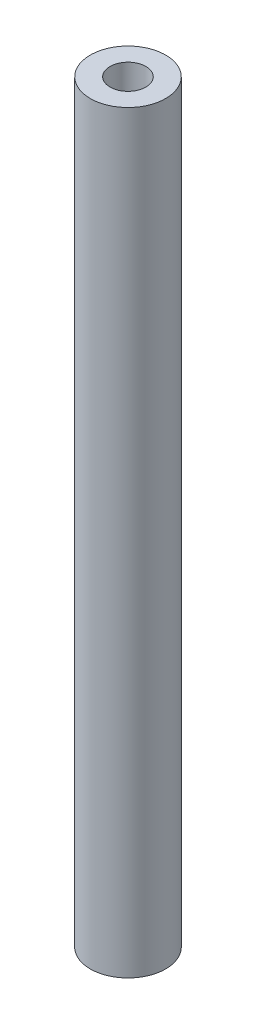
ISO-10303-21;
HEADER;
FILE_DESCRIPTION(('STEP AP214'),'2;1');
FILE_NAME('part.step','',(''),(''),'','','');
FILE_SCHEMA(('AUTOMOTIVE_DESIGN { 1 0 10303 214 1 1 1 1 }'));
ENDSEC;
DATA;
#1=APPLICATION_CONTEXT('core data for automotive mechanical design processes');
#2=APPLICATION_PROTOCOL_DEFINITION('international standard','automotive_design',2000,#1);
#3=PRODUCT_CONTEXT('',#1,'mechanical');
#4=PRODUCT('Part','Part','',(#3));
#5=PRODUCT_RELATED_PRODUCT_CATEGORY('part','',(#4));
#6=PRODUCT_DEFINITION_FORMATION('','',#4);
#7=PRODUCT_DEFINITION_CONTEXT('part definition',#1,'design');
#8=PRODUCT_DEFINITION('design','',#6,#7);
#9=PRODUCT_DEFINITION_SHAPE('','',#8);
#10=(LENGTH_UNIT() NAMED_UNIT(*) SI_UNIT(.MILLI.,.METRE.));
#11=(NAMED_UNIT(*) PLANE_ANGLE_UNIT() SI_UNIT($,.RADIAN.));
#12=(NAMED_UNIT(*) SI_UNIT($,.STERADIAN.) SOLID_ANGLE_UNIT());
#13=UNCERTAINTY_MEASURE_WITH_UNIT(LENGTH_MEASURE(1.E-05),#10,'distance_accuracy_value','');
#14=(GEOMETRIC_REPRESENTATION_CONTEXT(3) GLOBAL_UNCERTAINTY_ASSIGNED_CONTEXT((#13)) GLOBAL_UNIT_ASSIGNED_CONTEXT((#10,
#11,#12)) REPRESENTATION_CONTEXT('',''));
#15=CARTESIAN_POINT('',(0.,0.,0.));
#16=DIRECTION('',(0.,0.,1.));
#17=DIRECTION('',(1.,0.,0.));
#18=AXIS2_PLACEMENT_3D('',#15,#16,#17);
#19=CARTESIAN_POINT('',(0.,20.,0.));
#20=DIRECTION('',(0.,1.,0.));
#21=DIRECTION('',(0.,0.,1.));
#22=AXIS2_PLACEMENT_3D('',#19,#20,#21);
#23=PLANE('',#22);
#24=CARTESIAN_POINT('',(0.,20.,0.));
#25=DIRECTION('',(0.,1.,0.));
#26=DIRECTION('',(0.,0.,1.));
#27=AXIS2_PLACEMENT_3D('',#24,#25,#26);
#28=CIRCLE('',#27,2.);
#29=CARTESIAN_POINT('',(0.,20.,2.));
#30=VERTEX_POINT('',#29);
#31=EDGE_CURVE('E10',#30,#30,#28,.T.);
#32=ORIENTED_EDGE('',*,*,#31,.T.);
#33=EDGE_LOOP('',(#32));
#34=FACE_BOUND('',#33,.T.);
#35=CARTESIAN_POINT('',(0.,20.,0.));
#36=DIRECTION('',(0.,1.,0.));
#37=DIRECTION('',(0.,0.,1.));
#38=AXIS2_PLACEMENT_3D('',#35,#36,#37);
#39=CIRCLE('',#38,0.95);
#40=CARTESIAN_POINT('',(0.,20.,0.95));
#41=VERTEX_POINT('',#40);
#42=EDGE_CURVE('E43',#41,#41,#39,.T.);
#43=ORIENTED_EDGE('',*,*,#42,.F.);
#44=EDGE_LOOP('',(#43));
#45=FACE_BOUND('',#44,.T.);
#46=ADVANCED_FACE('F32',(#34,#45),#23,.T.);
#47=CARTESIAN_POINT('',(0.,-20.,0.));
#48=DIRECTION('',(0.,1.,0.));
#49=DIRECTION('',(0.,0.,1.));
#50=AXIS2_PLACEMENT_3D('',#47,#48,#49);
#51=PLANE('',#50);
#52=CARTESIAN_POINT('',(0.,-20.,0.));
#53=DIRECTION('',(0.,1.,0.));
#54=DIRECTION('',(0.,0.,1.));
#55=AXIS2_PLACEMENT_3D('',#52,#53,#54);
#56=CIRCLE('',#55,2.);
#57=CARTESIAN_POINT('',(0.,-20.,2.));
#58=VERTEX_POINT('',#57);
#59=EDGE_CURVE('E36',#58,#58,#56,.T.);
#60=ORIENTED_EDGE('',*,*,#59,.F.);
#61=EDGE_LOOP('',(#60));
#62=FACE_BOUND('',#61,.T.);
#63=CARTESIAN_POINT('',(0.,-20.,0.));
#64=DIRECTION('',(0.,1.,0.));
#65=DIRECTION('',(0.,0.,1.));
#66=AXIS2_PLACEMENT_3D('',#63,#64,#65);
#67=CIRCLE('',#66,0.95);
#68=CARTESIAN_POINT('',(0.,-20.,0.95));
#69=VERTEX_POINT('',#68);
#70=EDGE_CURVE('E45',#69,#69,#67,.T.);
#71=ORIENTED_EDGE('',*,*,#70,.T.);
#72=EDGE_LOOP('',(#71));
#73=FACE_BOUND('',#72,.T.);
#74=ADVANCED_FACE('F55',(#62,#73),#51,.F.);
#75=CARTESIAN_POINT('',(0.,20.,0.));
#76=DIRECTION('',(0.,-1.,0.));
#77=DIRECTION('',(0.,0.,-1.));
#78=AXIS2_PLACEMENT_3D('',#75,#76,#77);
#79=CYLINDRICAL_SURFACE('',#78,2.);
#80=ORIENTED_EDGE('',*,*,#31,.F.);
#81=EDGE_LOOP('',(#80));
#82=FACE_BOUND('',#81,.T.);
#83=ORIENTED_EDGE('',*,*,#59,.T.);
#84=EDGE_LOOP('',(#83));
#85=FACE_BOUND('',#84,.T.);
#86=ADVANCED_FACE('F34',(#82,#85),#79,.T.);
#87=CARTESIAN_POINT('',(0.,20.,0.));
#88=DIRECTION('',(0.,-1.,0.));
#89=DIRECTION('',(0.,0.,-1.));
#90=AXIS2_PLACEMENT_3D('',#87,#88,#89);
#91=CYLINDRICAL_SURFACE('',#90,0.95);
#92=ORIENTED_EDGE('',*,*,#42,.T.);
#93=EDGE_LOOP('',(#92));
#94=FACE_BOUND('',#93,.T.);
#95=ORIENTED_EDGE('',*,*,#70,.F.);
#96=EDGE_LOOP('',(#95));
#97=FACE_BOUND('',#96,.T.);
#98=ADVANCED_FACE('F51',(#94,#97),#91,.F.);
#99=CLOSED_SHELL('',(#46,#74,#86,#98));
#100=MANIFOLD_SOLID_BREP('B2',#99);
#101=ADVANCED_BREP_SHAPE_REPRESENTATION('',(#18,#100),#14);
#102=SHAPE_DEFINITION_REPRESENTATION(#9,#101);
ENDSEC;
END-ISO-10303-21;
